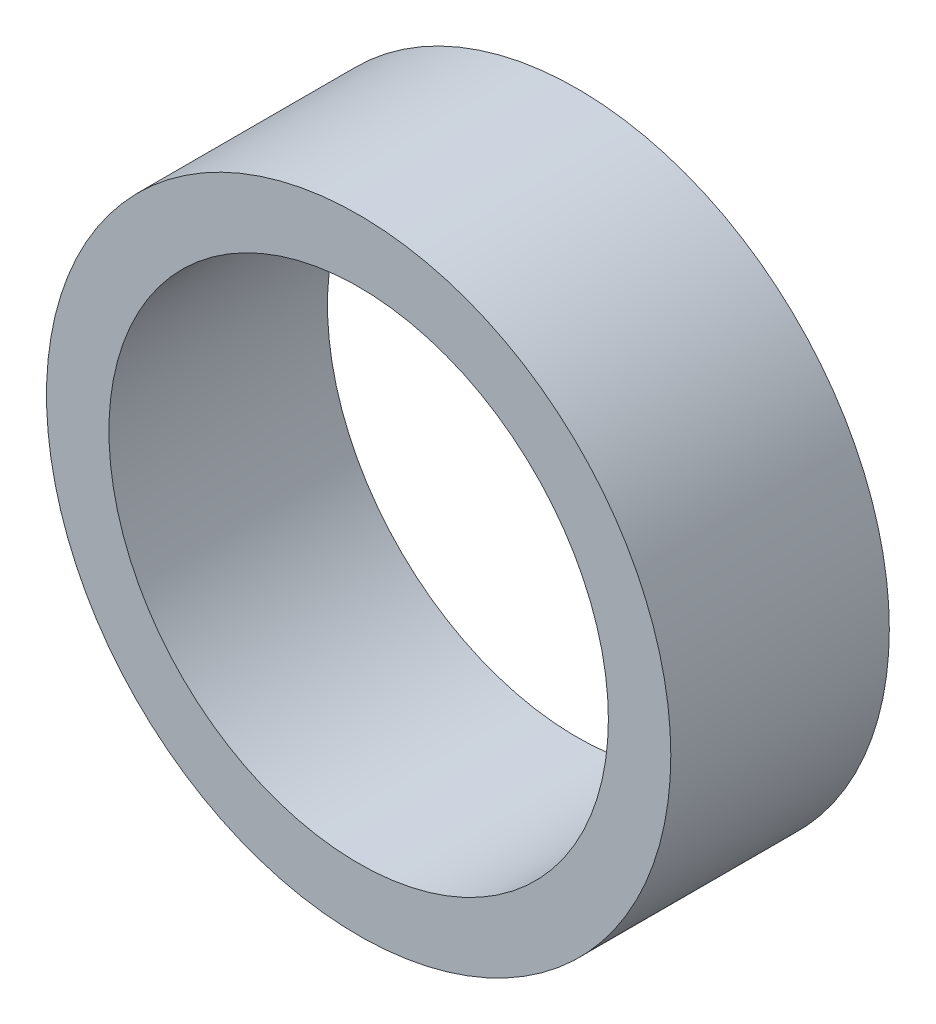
from build123d import *

# Parameters (mm, degrees)
SKETCH_1_R      = 5
SKETCH_1_R_2    = 4
EXTRUDE_1_DEPTH = 3.5


with BuildPart() as part:
    # Sketch 1 → Extrude 1 (new body)
    with BuildSketch(Plane.XY):
        Circle(SKETCH_1_R)
        Circle(SKETCH_1_R_2, mode=Mode.SUBTRACT)
    extrude(amount=EXTRUDE_1_DEPTH)


solid = part.part
